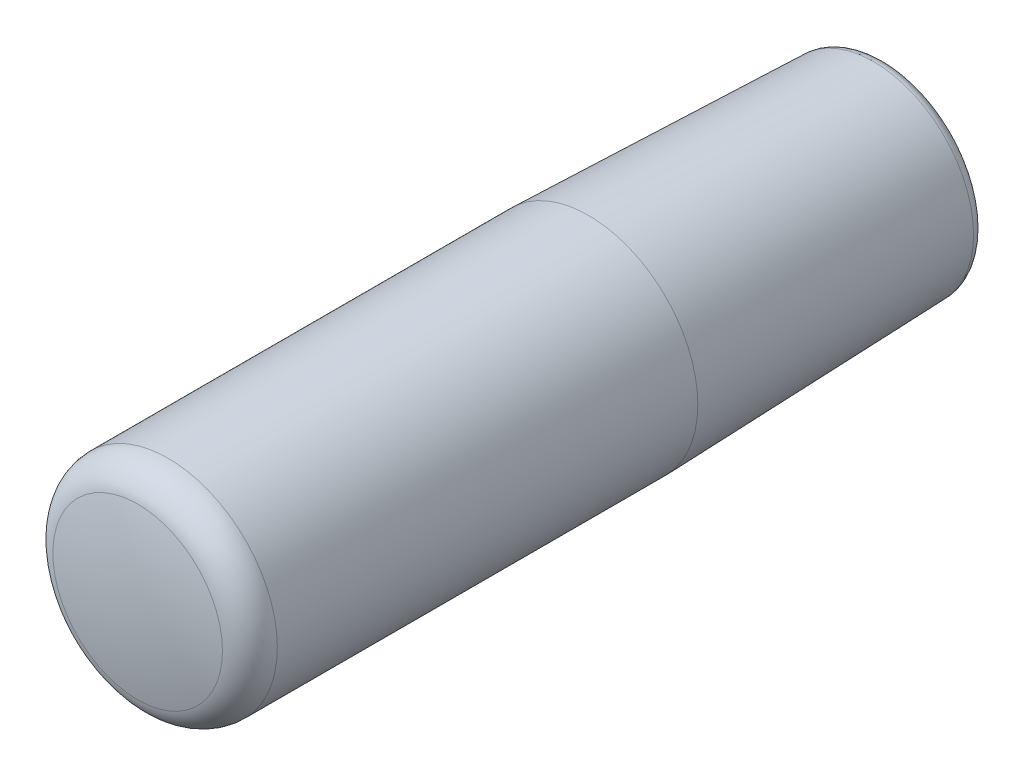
ISO-10303-21;
HEADER;
FILE_DESCRIPTION(('STEP AP214'),'2;1');
FILE_NAME('part.step','',(''),(''),'','','');
FILE_SCHEMA(('AUTOMOTIVE_DESIGN { 1 0 10303 214 1 1 1 1 }'));
ENDSEC;
DATA;
#1=APPLICATION_CONTEXT('core data for automotive mechanical design processes');
#2=APPLICATION_PROTOCOL_DEFINITION('international standard','automotive_design',2000,#1);
#3=PRODUCT_CONTEXT('',#1,'mechanical');
#4=PRODUCT('Part','Part','',(#3));
#5=PRODUCT_RELATED_PRODUCT_CATEGORY('part','',(#4));
#6=PRODUCT_DEFINITION_FORMATION('','',#4);
#7=PRODUCT_DEFINITION_CONTEXT('part definition',#1,'design');
#8=PRODUCT_DEFINITION('design','',#6,#7);
#9=PRODUCT_DEFINITION_SHAPE('','',#8);
#10=(LENGTH_UNIT() NAMED_UNIT(*) SI_UNIT(.MILLI.,.METRE.));
#11=(NAMED_UNIT(*) PLANE_ANGLE_UNIT() SI_UNIT($,.RADIAN.));
#12=(NAMED_UNIT(*) SI_UNIT($,.STERADIAN.) SOLID_ANGLE_UNIT());
#13=UNCERTAINTY_MEASURE_WITH_UNIT(LENGTH_MEASURE(1.E-05),#10,'distance_accuracy_value','');
#14=(GEOMETRIC_REPRESENTATION_CONTEXT(3) GLOBAL_UNCERTAINTY_ASSIGNED_CONTEXT((#13)) GLOBAL_UNIT_ASSIGNED_CONTEXT((#10,
#11,#12)) REPRESENTATION_CONTEXT('',''));
#15=CARTESIAN_POINT('',(0.,0.,0.));
#16=DIRECTION('',(0.,0.,1.));
#17=DIRECTION('',(1.,0.,0.));
#18=AXIS2_PLACEMENT_3D('',#15,#16,#17);
#19=CARTESIAN_POINT('',(0.,0.,26.));
#20=DIRECTION('',(0.,0.,1.));
#21=DIRECTION('',(1.,0.,0.));
#22=AXIS2_PLACEMENT_3D('',#19,#20,#21);
#23=PLANE('',#22);
#24=CARTESIAN_POINT('',(0.,0.,26.));
#25=DIRECTION('',(0.,0.,1.));
#26=DIRECTION('',(1.,0.,0.));
#27=AXIS2_PLACEMENT_3D('',#24,#25,#26);
#28=CIRCLE('',#27,7.98635891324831);
#29=CARTESIAN_POINT('',(7.98635891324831,0.,26.));
#30=VERTEX_POINT('',#29);
#31=EDGE_CURVE('E74',#30,#30,#28,.T.);
#32=ORIENTED_EDGE('',*,*,#31,.T.);
#33=EDGE_LOOP('',(#32));
#34=FACE_BOUND('',#33,.T.);
#35=CARTESIAN_POINT('',(0.,0.,26.));
#36=DIRECTION('',(0.,0.,1.));
#37=DIRECTION('',(1.,0.,0.));
#38=AXIS2_PLACEMENT_3D('',#35,#36,#37);
#39=CIRCLE('',#38,1.);
#40=CARTESIAN_POINT('',(1.,0.,26.));
#41=VERTEX_POINT('',#40);
#42=EDGE_CURVE('E23',#41,#41,#39,.T.);
#43=ORIENTED_EDGE('',*,*,#42,.F.);
#44=EDGE_LOOP('',(#43));
#45=FACE_BOUND('',#44,.T.);
#46=ADVANCED_FACE('F12',(#34,#45),#23,.T.);
#47=CARTESIAN_POINT('',(0.,0.,97.));
#48=DIRECTION('',(0.,0.,1.));
#49=DIRECTION('',(1.,0.,0.));
#50=AXIS2_PLACEMENT_3D('',#47,#48,#49);
#51=CYLINDRICAL_SURFACE('',#50,1.);
#52=ORIENTED_EDGE('',*,*,#42,.T.);
#53=EDGE_LOOP('',(#52));
#54=FACE_BOUND('',#53,.T.);
#55=CARTESIAN_POINT('',(0.,0.,95.9897948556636));
#56=DIRECTION('',(0.,0.,1.));
#57=DIRECTION('',(1.,0.,0.));
#58=AXIS2_PLACEMENT_3D('',#55,#56,#57);
#59=CIRCLE('',#58,1.);
#60=CARTESIAN_POINT('',(0.,-0.999999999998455,95.9897948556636));
#61=VERTEX_POINT('',#60);
#62=EDGE_CURVE('E27',#61,#61,#59,.T.);
#63=ORIENTED_EDGE('',*,*,#62,.F.);
#64=EDGE_LOOP('',(#63));
#65=FACE_BOUND('',#64,.T.);
#66=ADVANCED_FACE('F99',(#54,#65),#51,.T.);
#67=CARTESIAN_POINT('',(0.,0.,47.));
#68=DIRECTION('',(0.,0.,1.));
#69=DIRECTION('',(0.,-1.,0.));
#70=AXIS2_PLACEMENT_3D('',#67,#68,#69);
#71=SPHERICAL_SURFACE('',#70,49.);
#72=CARTESIAN_POINT('',(0.,0.,94.8281422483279));
#73=DIRECTION('',(0.,0.,1.));
#74=DIRECTION('',(1.,0.,0.));
#75=AXIS2_PLACEMENT_3D('',#72,#73,#74);
#76=CIRCLE('',#75,10.6521739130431);
#77=CARTESIAN_POINT('',(0.,-10.6521739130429,94.8281422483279));
#78=VERTEX_POINT('',#77);
#79=EDGE_CURVE('E32',#78,#78,#76,.T.);
#80=CARTESIAN_POINT('',(0.,-0.999999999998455,95.9897948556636));
#81=CARTESIAN_POINT('',(0.,-1.10141473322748,95.9877247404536));
#82=CARTESIAN_POINT('',(0.,-1.20282303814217,95.9853397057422));
#83=CARTESIAN_POINT('',(0.,-1.40562288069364,95.9799399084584));
#84=CARTESIAN_POINT('',(0.,-1.50701441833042,95.9769251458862));
#85=CARTESIAN_POINT('',(0.,-1.70977681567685,95.9702660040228));
#86=CARTESIAN_POINT('',(0.,-1.8111476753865,95.9666216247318));
#87=CARTESIAN_POINT('',(0.,-2.01386480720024,95.9587033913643));
#88=CARTESIAN_POINT('',(0.,-2.11521107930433,95.9544295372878));
#89=CARTESIAN_POINT('',(0.,-2.3178751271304,95.9452525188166));
#90=CARTESIAN_POINT('',(0.,-2.41919290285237,95.9403493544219));
#91=CARTESIAN_POINT('',(0.,-2.62179605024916,95.9299139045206));
#92=CARTESIAN_POINT('',(0.,-2.72308142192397,95.9243816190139));
#93=CARTESIAN_POINT('',(0.,-2.92561585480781,95.9126881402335));
#94=CARTESIAN_POINT('',(0.,-3.02686491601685,95.9065269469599));
#95=CARTESIAN_POINT('',(0.,-3.22932282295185,95.8935758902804));
#96=CARTESIAN_POINT('',(0.,-3.33053166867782,95.8867860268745));
#97=CARTESIAN_POINT('',(0.,-3.53290524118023,95.8725778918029));
#98=CARTESIAN_POINT('',(0.,-3.63406996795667,95.8651596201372));
#99=CARTESIAN_POINT('',(0.,-3.8363514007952,95.8496949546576));
#100=CARTESIAN_POINT('',(0.,-3.9374681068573,95.8416485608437));
#101=CARTESIAN_POINT('',(0.,-4.13964959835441,95.8249279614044));
#102=CARTESIAN_POINT('',(0.,-4.24071438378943,95.816253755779));
#103=CARTESIAN_POINT('',(0.,-4.44278813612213,95.7982778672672));
#104=CARTESIAN_POINT('',(0.,-4.54379710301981,95.7889761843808));
#105=CARTESIAN_POINT('',(0.,-4.74575532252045,95.7697457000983));
#106=CARTESIAN_POINT('',(0.,-4.84670457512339,95.7598168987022));
#107=CARTESIAN_POINT('',(0.,-5.04853947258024,95.7393325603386));
#108=CARTESIAN_POINT('',(0.,-5.14942511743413,95.7287770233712));
#109=CARTESIAN_POINT('',(0.,-5.35112890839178,95.7070396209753));
#110=CARTESIAN_POINT('',(0.,-5.45194705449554,95.695857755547));
#111=CARTESIAN_POINT('',(0.,-5.65351195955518,95.6728681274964));
#112=CARTESIAN_POINT('',(0.,-5.75425871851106,95.6610603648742));
#113=CARTESIAN_POINT('',(0.,-5.95567696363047,95.6368193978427));
#114=CARTESIAN_POINT('',(0.,-6.05634844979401,95.6243861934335));
#115=CARTESIAN_POINT('',(0.,-6.25761226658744,95.5988948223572));
#116=CARTESIAN_POINT('',(0.,-6.35820459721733,95.5858366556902));
#117=CARTESIAN_POINT('',(0.,-6.55930622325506,95.5590958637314));
#118=CARTESIAN_POINT('',(0.,-6.65981551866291,95.5454132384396));
#119=CARTESIAN_POINT('',(0.,-6.86074719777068,95.5174240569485));
#120=CARTESIAN_POINT('',(0.,-6.96116958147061,95.5031175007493));
#121=CARTESIAN_POINT('',(0.,-7.16192356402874,95.4738810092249));
#122=CARTESIAN_POINT('',(0.,-7.26225516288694,95.4589510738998));
#123=CARTESIAN_POINT('',(0.,-7.46282370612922,95.4284683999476));
#124=CARTESIAN_POINT('',(0.,-7.56306065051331,95.4129156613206));
#125=CARTESIAN_POINT('',(0.,-7.76343601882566,95.3811879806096));
#126=CARTESIAN_POINT('',(0.,-7.86357444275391,95.3650130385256));
#127=CARTESIAN_POINT('',(0.,-8.06374890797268,95.3320415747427));
#128=CARTESIAN_POINT('',(0.,-8.1637849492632,95.3152450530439));
#129=CARTESIAN_POINT('',(0.,-8.3637507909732,95.2810310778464));
#130=CARTESIAN_POINT('',(0.,-8.46368059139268,95.2636136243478));
#131=CARTESIAN_POINT('',(0.,-8.66343009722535,95.2281584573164));
#132=CARTESIAN_POINT('',(0.,-8.76324980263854,95.2101207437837));
#133=CARTESIAN_POINT('',(0.,-8.96277526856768,95.1734257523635));
#134=CARTESIAN_POINT('',(0.,-9.06248102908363,95.1547684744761));
#135=CARTESIAN_POINT('',(0.,-9.26177475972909,95.1168350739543));
#136=CARTESIAN_POINT('',(0.,-9.3613627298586,95.09755895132));
#137=CARTESIAN_POINT('',(0.,-9.56041703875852,95.0583886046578));
#138=CARTESIAN_POINT('',(0.,-9.65988337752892,95.0384943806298));
#139=CARTESIAN_POINT('',(0.,-9.85869058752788,94.9980885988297));
#140=CARTESIAN_POINT('',(0.,-9.95803145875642,94.9775770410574));
#141=CARTESIAN_POINT('',(0.,-10.1565839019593,94.9359373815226));
#142=CARTESIAN_POINT('',(0.,-10.2557954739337,94.91480927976));
#143=CARTESIAN_POINT('',(0.,-10.4540854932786,94.8719373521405));
#144=CARTESIAN_POINT('',(0.,-10.5531639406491,94.8501935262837));
#145=CARTESIAN_POINT('',(0.,-10.6521739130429,94.8281422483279));
#146=B_SPLINE_CURVE_WITH_KNOTS('',3,(#80,#81,#82,#83,#84,#85,#86,#87,#88,#89,#90,#91,#92,#93,
#94,#95,#96,#97,#98,#99,#100,#101,#102,#103,#104,#105,#106,#107,#108,#109,#110,#111,#112,#113,
#114,#115,#116,#117,#118,#119,#120,#121,#122,#123,#124,#125,#126,#127,#128,#129,#130,#131,#132,
#133,#134,#135,#136,#137,#138,#139,#140,#141,#142,#143,#144,#145),.UNSPECIFIED.,.F.,.F.,(4,2,2,
2,2,2,2,2,2,2,2,2,2,2,2,2,2,2,2,2,2,2,2,2,2,2,2,2,2,2,2,2,4),(0.,0.304307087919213,
0.608614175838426,0.912921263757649,1.21722835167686,1.52153543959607,1.8258425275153,
2.13014961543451,2.43445670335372,2.73876379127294,3.04307087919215,3.34737796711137,
3.65168505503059,3.9559921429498,4.26029923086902,4.56460631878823,4.86891340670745,
5.17322049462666,5.47752758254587,5.78183467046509,6.08614175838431,6.39044884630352,
6.69475593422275,6.99906302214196,7.30337011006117,7.60767719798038,7.9119842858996,
8.21629137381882,8.52059846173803,8.82490554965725,9.12921263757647,9.43351972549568,
9.7378268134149),.UNSPECIFIED.);
#147=EDGE_CURVE('BSEAM104',#61,#78,#146,.T.);
#148=ORIENTED_EDGE('',*,*,#62,.T.);
#149=ORIENTED_EDGE('',*,*,#79,.F.);
#150=ORIENTED_EDGE('',*,*,#147,.T.);
#151=ORIENTED_EDGE('',*,*,#147,.F.);
#152=EDGE_LOOP('',(#148,#150,#149,#151));
#153=FACE_BOUND('',#152,.T.);
#154=ADVANCED_FACE('F104',(#153),#71,.F.);
#155=CARTESIAN_POINT('',(0.,0.,91.8998886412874));
#156=DIRECTION('',(0.,0.,1.));
#157=DIRECTION('',(1.,0.,0.));
#158=AXIS2_PLACEMENT_3D('',#155,#156,#157);
#159=TOROIDAL_SURFACE('',#158,10.,2.99999999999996);
#160=ORIENTED_EDGE('',*,*,#79,.T.);
#161=EDGE_LOOP('',(#160));
#162=FACE_BOUND('',#161,.T.);
#163=CARTESIAN_POINT('',(0.,0.,91.8998886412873));
#164=DIRECTION('',(0.,0.,1.));
#165=DIRECTION('',(1.,0.,0.));
#166=AXIS2_PLACEMENT_3D('',#163,#164,#165);
#167=CIRCLE('',#166,13.);
#168=CARTESIAN_POINT('',(13.,0.,91.8998886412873));
#169=VERTEX_POINT('',#168);
#170=EDGE_CURVE('E35',#169,#169,#167,.T.);
#171=ORIENTED_EDGE('',*,*,#170,.F.);
#172=EDGE_LOOP('',(#171));
#173=FACE_BOUND('',#172,.T.);
#174=ADVANCED_FACE('F110',(#162,#173),#159,.F.);
#175=CARTESIAN_POINT('',(0.,0.,97.));
#176=DIRECTION('',(0.,0.,1.));
#177=DIRECTION('',(1.,0.,0.));
#178=AXIS2_PLACEMENT_3D('',#175,#176,#177);
#179=CYLINDRICAL_SURFACE('',#178,13.);
#180=ORIENTED_EDGE('',*,*,#170,.T.);
#181=EDGE_LOOP('',(#180));
#182=FACE_BOUND('',#181,.T.);
#183=CARTESIAN_POINT('',(0.,0.,38.0164429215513));
#184=DIRECTION('',(0.,0.,1.));
#185=DIRECTION('',(1.,0.,0.));
#186=AXIS2_PLACEMENT_3D('',#183,#184,#185);
#187=CIRCLE('',#186,13.);
#188=CARTESIAN_POINT('',(13.,0.,38.0164429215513));
#189=VERTEX_POINT('',#188);
#190=EDGE_CURVE('E38',#189,#189,#187,.T.);
#191=ORIENTED_EDGE('',*,*,#190,.F.);
#192=EDGE_LOOP('',(#191));
#193=FACE_BOUND('',#192,.T.);
#194=ADVANCED_FACE('F114',(#182,#193),#179,.F.);
#195=CARTESIAN_POINT('',(0.,0.,1.48356152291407));
#196=DIRECTION('',(0.,0.,1.));
#197=DIRECTION('',(1.,0.,0.));
#198=AXIS2_PLACEMENT_3D('',#195,#196,#197);
#199=CONICAL_SURFACE('',#198,11.798260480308,0.0328828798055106);
#200=ORIENTED_EDGE('',*,*,#190,.T.);
#201=EDGE_LOOP('',(#200));
#202=FACE_BOUND('',#201,.T.);
#203=CARTESIAN_POINT('',(0.,0.,1.48356152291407));
#204=DIRECTION('',(0.,0.,1.));
#205=DIRECTION('',(1.,0.,0.));
#206=AXIS2_PLACEMENT_3D('',#203,#204,#205);
#207=CIRCLE('',#206,11.798260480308);
#208=CARTESIAN_POINT('',(11.798260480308,0.,1.48356152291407));
#209=VERTEX_POINT('',#208);
#210=EDGE_CURVE('E41',#209,#209,#207,.T.);
#211=ORIENTED_EDGE('',*,*,#210,.F.);
#212=EDGE_LOOP('',(#211));
#213=FACE_BOUND('',#212,.T.);
#214=ADVANCED_FACE('F118',(#202,#213),#199,.F.);
#215=CARTESIAN_POINT('',(0.,0.,1.5));
#216=DIRECTION('',(0.,0.,1.));
#217=DIRECTION('',(1.,0.,0.));
#218=AXIS2_PLACEMENT_3D('',#215,#216,#217);
#219=TOROIDAL_SURFACE('',#218,11.2985307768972,0.5);
#220=ORIENTED_EDGE('',*,*,#210,.T.);
#221=EDGE_LOOP('',(#220));
#222=FACE_BOUND('',#221,.T.);
#223=CARTESIAN_POINT('',(0.,0.,1.));
#224=DIRECTION('',(0.,0.,1.));
#225=DIRECTION('',(1.,0.,0.));
#226=AXIS2_PLACEMENT_3D('',#223,#224,#225);
#227=CIRCLE('',#226,11.2985307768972);
#228=CARTESIAN_POINT('',(11.2985307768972,0.,1.));
#229=VERTEX_POINT('',#228);
#230=EDGE_CURVE('E44',#229,#229,#227,.T.);
#231=ORIENTED_EDGE('',*,*,#230,.F.);
#232=EDGE_LOOP('',(#231));
#233=FACE_BOUND('',#232,.T.);
#234=ADVANCED_FACE('F122',(#222,#233),#219,.F.);
#235=CARTESIAN_POINT('',(0.,-7.99999952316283,1.));
#236=DIRECTION('',(0.,0.,1.));
#237=DIRECTION('',(1.,0.,0.));
#238=AXIS2_PLACEMENT_3D('',#235,#236,#237);
#239=PLANE('',#238);
#240=ORIENTED_EDGE('',*,*,#230,.T.);
#241=EDGE_LOOP('',(#240));
#242=FACE_BOUND('',#241,.T.);
#243=CARTESIAN_POINT('',(0.,0.,1.));
#244=DIRECTION('',(0.,0.,1.));
#245=DIRECTION('',(1.,0.,0.));
#246=AXIS2_PLACEMENT_3D('',#243,#244,#245);
#247=CIRCLE('',#246,8.99999952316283);
#248=CARTESIAN_POINT('',(8.99999952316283,0.,1.));
#249=VERTEX_POINT('',#248);
#250=EDGE_CURVE('E47',#249,#249,#247,.T.);
#251=ORIENTED_EDGE('',*,*,#250,.F.);
#252=EDGE_LOOP('',(#251));
#253=FACE_BOUND('',#252,.T.);
#254=ADVANCED_FACE('F126',(#242,#253),#239,.T.);
#255=CARTESIAN_POINT('',(0.,0.,97.));
#256=DIRECTION('',(0.,0.,1.));
#257=DIRECTION('',(1.,0.,0.));
#258=AXIS2_PLACEMENT_3D('',#255,#256,#257);
#259=CYLINDRICAL_SURFACE('',#258,8.99999952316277);
#260=ORIENTED_EDGE('',*,*,#250,.T.);
#261=EDGE_LOOP('',(#260));
#262=FACE_BOUND('',#261,.T.);
#263=CARTESIAN_POINT('',(0.,0.,25.));
#264=DIRECTION('',(0.,0.,1.));
#265=DIRECTION('',(1.,0.,0.));
#266=AXIS2_PLACEMENT_3D('',#263,#264,#265);
#267=CIRCLE('',#266,8.99999952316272);
#268=CARTESIAN_POINT('',(8.99999952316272,0.,25.));
#269=VERTEX_POINT('',#268);
#270=EDGE_CURVE('E50',#269,#269,#267,.T.);
#271=ORIENTED_EDGE('',*,*,#270,.F.);
#272=EDGE_LOOP('',(#271));
#273=FACE_BOUND('',#272,.T.);
#274=ADVANCED_FACE('F130',(#262,#273),#259,.T.);
#275=CARTESIAN_POINT('',(0.,-8.99999952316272,25.));
#276=DIRECTION('',(0.,0.,-1.));
#277=DIRECTION('',(-1.,0.,0.));
#278=AXIS2_PLACEMENT_3D('',#275,#276,#277);
#279=PLANE('',#278);
#280=CARTESIAN_POINT('',(0.,0.,25.));
#281=DIRECTION('',(0.,0.,1.));
#282=DIRECTION('',(1.,0.,0.));
#283=AXIS2_PLACEMENT_3D('',#280,#281,#282);
#284=CIRCLE('',#283,7.99999952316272);
#285=CARTESIAN_POINT('',(7.99999952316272,0.,25.));
#286=VERTEX_POINT('',#285);
#287=EDGE_CURVE('E53',#286,#286,#284,.T.);
#288=ORIENTED_EDGE('',*,*,#287,.F.);
#289=EDGE_LOOP('',(#288));
#290=FACE_BOUND('',#289,.T.);
#291=ORIENTED_EDGE('',*,*,#270,.T.);
#292=EDGE_LOOP('',(#291));
#293=FACE_BOUND('',#292,.T.);
#294=ADVANCED_FACE('F134',(#290,#293),#279,.F.);
#295=CARTESIAN_POINT('',(0.,0.,97.));
#296=DIRECTION('',(0.,0.,1.));
#297=DIRECTION('',(1.,0.,0.));
#298=AXIS2_PLACEMENT_3D('',#295,#296,#297);
#299=CYLINDRICAL_SURFACE('',#298,7.99999952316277);
#300=CARTESIAN_POINT('',(0.,0.,1.00000000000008));
#301=DIRECTION('',(0.,0.,1.));
#302=DIRECTION('',(1.,0.,0.));
#303=AXIS2_PLACEMENT_3D('',#300,#301,#302);
#304=CIRCLE('',#303,7.99999952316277);
#305=CARTESIAN_POINT('',(7.99999952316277,0.,1.00000000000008));
#306=VERTEX_POINT('',#305);
#307=EDGE_CURVE('E8',#306,#306,#304,.F.);
#308=ORIENTED_EDGE('',*,*,#307,.T.);
#309=EDGE_LOOP('',(#308));
#310=FACE_BOUND('',#309,.T.);
#311=ORIENTED_EDGE('',*,*,#287,.T.);
#312=EDGE_LOOP('',(#311));
#313=FACE_BOUND('',#312,.T.);
#314=ADVANCED_FACE('F138',(#310,#313),#299,.F.);
#315=CARTESIAN_POINT('',(0.,-7.99999952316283,0.));
#316=DIRECTION('',(0.,0.,1.));
#317=DIRECTION('',(1.,0.,0.));
#318=AXIS2_PLACEMENT_3D('',#315,#316,#317);
#319=PLANE('',#318);
#320=CARTESIAN_POINT('',(0.,0.,0.));
#321=DIRECTION('',(0.,0.,1.));
#322=DIRECTION('',(1.,0.,0.));
#323=AXIS2_PLACEMENT_3D('',#320,#321,#322);
#324=CIRCLE('',#323,8.99999952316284);
#325=CARTESIAN_POINT('',(8.99999952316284,0.,0.));
#326=VERTEX_POINT('',#325);
#327=EDGE_CURVE('E19',#326,#326,#324,.T.);
#328=ORIENTED_EDGE('',*,*,#327,.T.);
#329=EDGE_LOOP('',(#328));
#330=FACE_BOUND('',#329,.T.);
#331=CARTESIAN_POINT('',(0.,0.,0.));
#332=DIRECTION('',(0.,0.,1.));
#333=DIRECTION('',(1.,0.,0.));
#334=AXIS2_PLACEMENT_3D('',#331,#332,#333);
#335=CIRCLE('',#334,11.2985307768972);
#336=CARTESIAN_POINT('',(11.2985307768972,0.,0.));
#337=VERTEX_POINT('',#336);
#338=EDGE_CURVE('E56',#337,#337,#335,.T.);
#339=ORIENTED_EDGE('',*,*,#338,.F.);
#340=EDGE_LOOP('',(#339));
#341=FACE_BOUND('',#340,.T.);
#342=ADVANCED_FACE('F142',(#330,#341),#319,.F.);
#343=CARTESIAN_POINT('',(0.,0.,1.5));
#344=DIRECTION('',(0.,0.,1.));
#345=DIRECTION('',(1.,0.,0.));
#346=AXIS2_PLACEMENT_3D('',#343,#344,#345);
#347=TOROIDAL_SURFACE('',#346,11.2985307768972,1.5);
#348=CARTESIAN_POINT('',(0.,0.,1.45068456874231));
#349=DIRECTION('',(0.,0.,1.));
#350=DIRECTION('',(1.,0.,0.));
#351=AXIS2_PLACEMENT_3D('',#348,#349,#350);
#352=CIRCLE('',#351,12.7977198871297);
#353=CARTESIAN_POINT('',(12.7977198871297,0.,1.45068456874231));
#354=VERTEX_POINT('',#353);
#355=EDGE_CURVE('E59',#354,#354,#352,.T.);
#356=ORIENTED_EDGE('',*,*,#355,.F.);
#357=EDGE_LOOP('',(#356));
#358=FACE_BOUND('',#357,.T.);
#359=ORIENTED_EDGE('',*,*,#338,.T.);
#360=EDGE_LOOP('',(#359));
#361=FACE_BOUND('',#360,.T.);
#362=ADVANCED_FACE('F145',(#358,#361),#347,.T.);
#363=CARTESIAN_POINT('',(0.,0.,1.45068456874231));
#364=DIRECTION('',(0.,0.,1.));
#365=DIRECTION('',(1.,0.,0.));
#366=AXIS2_PLACEMENT_3D('',#363,#364,#365);
#367=CONICAL_SURFACE('',#366,12.7977198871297,0.0328828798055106);
#368=CARTESIAN_POINT('',(0.,0.,38.));
#369=DIRECTION('',(0.,0.,1.));
#370=DIRECTION('',(1.,0.,0.));
#371=AXIS2_PLACEMENT_3D('',#368,#369,#370);
#372=CIRCLE('',#371,14.);
#373=CARTESIAN_POINT('',(14.,0.,38.));
#374=VERTEX_POINT('',#373);
#375=EDGE_CURVE('E62',#374,#374,#372,.T.);
#376=ORIENTED_EDGE('',*,*,#375,.F.);
#377=EDGE_LOOP('',(#376));
#378=FACE_BOUND('',#377,.T.);
#379=ORIENTED_EDGE('',*,*,#355,.T.);
#380=EDGE_LOOP('',(#379));
#381=FACE_BOUND('',#380,.T.);
#382=ADVANCED_FACE('F148',(#378,#381),#367,.T.);
#383=CARTESIAN_POINT('',(0.,0.,97.));
#384=DIRECTION('',(0.,0.,1.));
#385=DIRECTION('',(1.,0.,0.));
#386=AXIS2_PLACEMENT_3D('',#383,#384,#385);
#387=CYLINDRICAL_SURFACE('',#386,14.);
#388=CARTESIAN_POINT('',(0.,0.,91.8998886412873));
#389=DIRECTION('',(0.,0.,1.));
#390=DIRECTION('',(1.,0.,0.));
#391=AXIS2_PLACEMENT_3D('',#388,#389,#390);
#392=CIRCLE('',#391,14.);
#393=CARTESIAN_POINT('',(14.,0.,91.8998886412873));
#394=VERTEX_POINT('',#393);
#395=EDGE_CURVE('E65',#394,#394,#392,.T.);
#396=ORIENTED_EDGE('',*,*,#395,.F.);
#397=EDGE_LOOP('',(#396));
#398=FACE_BOUND('',#397,.T.);
#399=ORIENTED_EDGE('',*,*,#375,.T.);
#400=EDGE_LOOP('',(#399));
#401=FACE_BOUND('',#400,.T.);
#402=ADVANCED_FACE('F152',(#398,#401),#387,.T.);
#403=CARTESIAN_POINT('',(0.,0.,91.8998886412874));
#404=DIRECTION('',(0.,0.,1.));
#405=DIRECTION('',(1.,0.,0.));
#406=AXIS2_PLACEMENT_3D('',#403,#404,#405);
#407=TOROIDAL_SURFACE('',#406,10.,3.99999999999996);
#408=CARTESIAN_POINT('',(0.,0.,95.804226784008));
#409=DIRECTION('',(0.,0.,1.));
#410=DIRECTION('',(1.,0.,0.));
#411=AXIS2_PLACEMENT_3D('',#408,#409,#410);
#412=CIRCLE('',#411,10.8695652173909);
#413=CARTESIAN_POINT('',(10.8695652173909,0.,95.804226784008));
#414=VERTEX_POINT('',#413);
#415=EDGE_CURVE('E68',#414,#414,#412,.T.);
#416=ORIENTED_EDGE('',*,*,#415,.F.);
#417=EDGE_LOOP('',(#416));
#418=FACE_BOUND('',#417,.T.);
#419=ORIENTED_EDGE('',*,*,#395,.T.);
#420=EDGE_LOOP('',(#419));
#421=FACE_BOUND('',#420,.T.);
#422=ADVANCED_FACE('F95',(#418,#421),#407,.T.);
#423=CARTESIAN_POINT('',(0.,0.,47.));
#424=DIRECTION('',(0.,0.,1.));
#425=DIRECTION('',(0.,-1.,0.));
#426=AXIS2_PLACEMENT_3D('',#423,#424,#425);
#427=SPHERICAL_SURFACE('',#426,50.);
#428=ORIENTED_EDGE('',*,*,#415,.T.);
#429=EDGE_LOOP('',(#428));
#430=FACE_BOUND('',#429,.T.);
#431=ADVANCED_FACE('F88',(#430),#427,.T.);
#432=CARTESIAN_POINT('',(0.,0.,25.));
#433=DIRECTION('',(0.,0.,1.));
#434=DIRECTION('',(1.,0.,0.));
#435=AXIS2_PLACEMENT_3D('',#432,#433,#434);
#436=PLANE('',#435);
#437=CARTESIAN_POINT('',(0.,0.,25.));
#438=DIRECTION('',(0.,0.,1.));
#439=DIRECTION('',(1.,0.,0.));
#440=AXIS2_PLACEMENT_3D('',#437,#438,#439);
#441=CIRCLE('',#440,7.98635891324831);
#442=CARTESIAN_POINT('',(7.98635891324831,0.,25.));
#443=VERTEX_POINT('',#442);
#444=EDGE_CURVE('E71',#443,#443,#441,.T.);
#445=ORIENTED_EDGE('',*,*,#444,.F.);
#446=EDGE_LOOP('',(#445));
#447=FACE_BOUND('',#446,.T.);
#448=ADVANCED_FACE('F83',(#447),#436,.F.);
#449=CARTESIAN_POINT('',(0.,0.,97.));
#450=DIRECTION('',(0.,0.,1.));
#451=DIRECTION('',(1.,0.,0.));
#452=AXIS2_PLACEMENT_3D('',#449,#450,#451);
#453=CYLINDRICAL_SURFACE('',#452,7.98635891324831);
#454=ORIENTED_EDGE('',*,*,#31,.F.);
#455=EDGE_LOOP('',(#454));
#456=FACE_BOUND('',#455,.T.);
#457=ORIENTED_EDGE('',*,*,#444,.T.);
#458=EDGE_LOOP('',(#457));
#459=FACE_BOUND('',#458,.T.);
#460=ADVANCED_FACE('F80',(#456,#459),#453,.T.);
#461=CARTESIAN_POINT('',(0.,0.,0.));
#462=DIRECTION('',(0.,0.,-1.));
#463=DIRECTION('',(-1.,0.,0.));
#464=AXIS2_PLACEMENT_3D('',#461,#462,#463);
#465=CONICAL_SURFACE('',#464,8.99999952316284,0.785398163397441);
#466=ORIENTED_EDGE('',*,*,#307,.F.);
#467=EDGE_LOOP('',(#466));
#468=FACE_BOUND('',#467,.T.);
#469=ORIENTED_EDGE('',*,*,#327,.F.);
#470=EDGE_LOOP('',(#469));
#471=FACE_BOUND('',#470,.T.);
#472=ADVANCED_FACE('F14',(#468,#471),#465,.F.);
#473=CLOSED_SHELL('',(#46,#66,#154,#174,#194,#214,#234,#254,#274,#294,#314,#342,#362,#382,#402,
#422,#431,#448,#460,#472));
#474=MANIFOLD_SOLID_BREP('B1',#473);
#475=ADVANCED_BREP_SHAPE_REPRESENTATION('',(#18,#474),#14);
#476=SHAPE_DEFINITION_REPRESENTATION(#9,#475);
ENDSEC;
END-ISO-10303-21;
